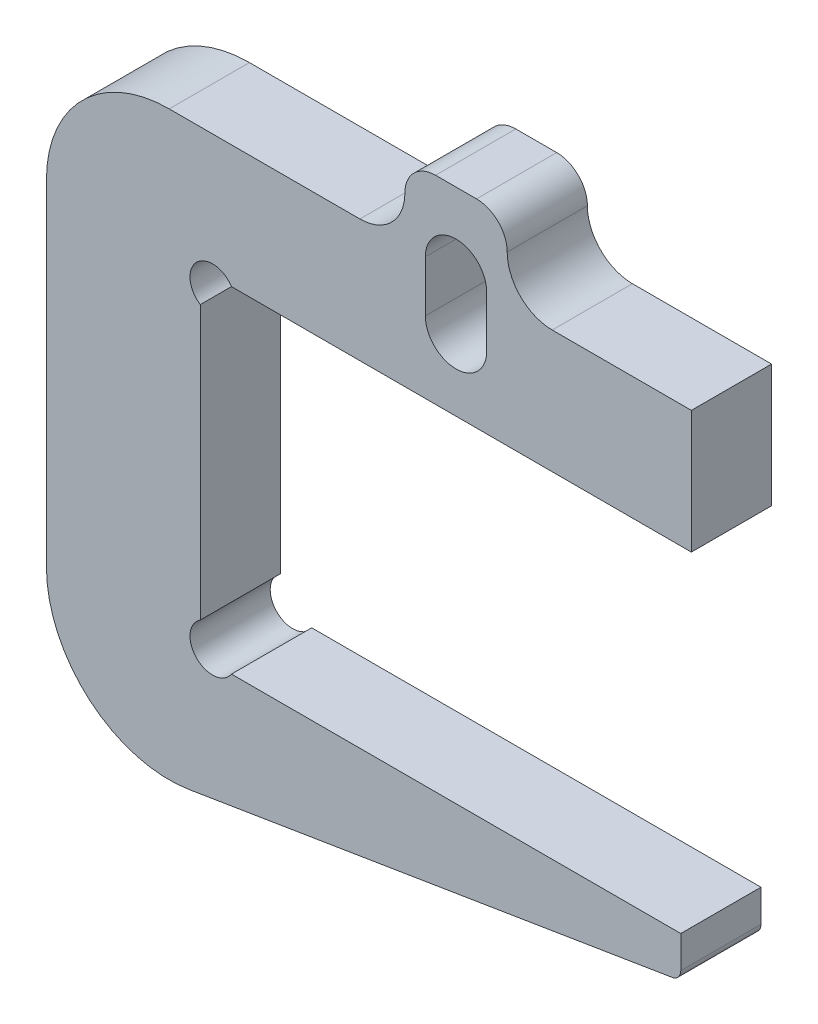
from build123d import *

# Parameters (mm, degrees)
BOSS_EXTRU_1_DEPTH = 97.984695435


with BuildPart() as part:
    # Esquisse1 → Boss.-Extru.1 (new, symmetric)
    with BuildSketch(Plane.XY):
        with BuildLine():
            Line((575, -300), (-548.781258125, -300))
            ThreePointArc((-548.781258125, -300), (-633.96262376, -291.03737624), (-625, -376.218741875))
            Line((-625, -376.218741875), (-625, -1043.781258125))
            ThreePointArc((-625, -1043.781258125), (-633.96262376, -1128.96262376), (-548.781258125, -1120))
            Line((-548.781258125, -1120), (549.118041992, -1120))
            Line((549.118041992, -1120), (549.118041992, -1198.748716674))
            ThreePointArc((549.118041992, -1198.748716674), (543.166042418, -1214.940494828), (528.14414761, -1223.422396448))
            Line((528.14414761, -1223.422396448), (-652.56869059, -1416.084157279))
            ThreePointArc((-652.56869059, -1416.084157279), (-895.18329585, -1348.576005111), (-1000.881958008, -1120))
            Line((-1000.881958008, -1120), (-1000.881958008, -300))
            ThreePointArc((-1000.881958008, -300), (-913.013992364, -87.867965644), (-700.881958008, 0))
            Line((-700.881958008, 0), (-235, 0))
            ThreePointArc((-235, 0), (-157.218254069, 32.218254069), (-125, 110))
            ThreePointArc((-125, 110), (-103.033008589, 163.033008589), (-50, 185))
            Line((-50, 185), (50, 185))
            ThreePointArc((50, 185), (103.033008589, 163.033008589), (125, 110))
            ThreePointArc((125, 110), (157.218254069, 32.218254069), (235, 0))
            Line((235, 0), (575, 0))
            Line((575, 0), (575, -300))
        make_face()
        with BuildLine():
            Line((-75, 0), (-75, -125))
            ThreePointArc((-75, -125), (0, -200), (75, -125))
            Line((75, -125), (75, 0))
            ThreePointArc((75, 0), (0, 75), (-75, 0))
        make_face(mode=Mode.SUBTRACT)
    extrude(amount=BOSS_EXTRU_1_DEPTH, both=True)


solid = part.part
